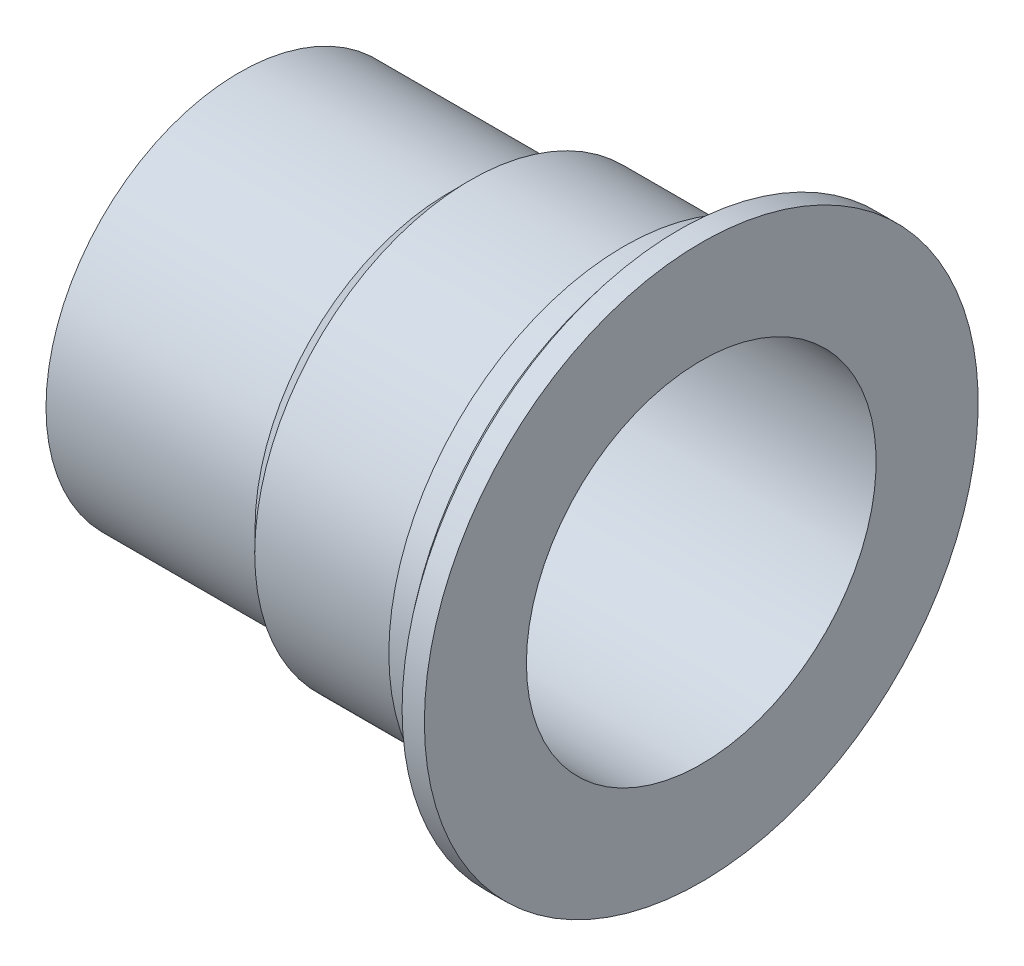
ISO-10303-21;
HEADER;
FILE_DESCRIPTION(('STEP AP214'),'2;1');
FILE_NAME('part.step','',(''),(''),'','','');
FILE_SCHEMA(('AUTOMOTIVE_DESIGN { 1 0 10303 214 1 1 1 1 }'));
ENDSEC;
DATA;
#1=APPLICATION_CONTEXT('core data for automotive mechanical design processes');
#2=APPLICATION_PROTOCOL_DEFINITION('international standard','automotive_design',2000,#1);
#3=PRODUCT_CONTEXT('',#1,'mechanical');
#4=PRODUCT('Part','Part','',(#3));
#5=PRODUCT_RELATED_PRODUCT_CATEGORY('part','',(#4));
#6=PRODUCT_DEFINITION_FORMATION('','',#4);
#7=PRODUCT_DEFINITION_CONTEXT('part definition',#1,'design');
#8=PRODUCT_DEFINITION('design','',#6,#7);
#9=PRODUCT_DEFINITION_SHAPE('','',#8);
#10=(LENGTH_UNIT() NAMED_UNIT(*) SI_UNIT(.MILLI.,.METRE.));
#11=(NAMED_UNIT(*) PLANE_ANGLE_UNIT() SI_UNIT($,.RADIAN.));
#12=(NAMED_UNIT(*) SI_UNIT($,.STERADIAN.) SOLID_ANGLE_UNIT());
#13=UNCERTAINTY_MEASURE_WITH_UNIT(LENGTH_MEASURE(1.E-05),#10,'distance_accuracy_value','');
#14=(GEOMETRIC_REPRESENTATION_CONTEXT(3) GLOBAL_UNCERTAINTY_ASSIGNED_CONTEXT((#13)) GLOBAL_UNIT_ASSIGNED_CONTEXT((#10,
#11,#12)) REPRESENTATION_CONTEXT('',''));
#15=CARTESIAN_POINT('',(0.,0.,0.));
#16=DIRECTION('',(0.,0.,1.));
#17=DIRECTION('',(1.,0.,0.));
#18=AXIS2_PLACEMENT_3D('',#15,#16,#17);
#19=CARTESIAN_POINT('',(239.842,45.71498772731,-25.62336));
#20=DIRECTION('',(-1.,0.,0.));
#21=DIRECTION('',(0.,0.,1.));
#22=AXIS2_PLACEMENT_3D('',#19,#20,#21);
#23=PLANE('',#22);
#24=CARTESIAN_POINT('',(239.842,0.,0.));
#25=DIRECTION('',(-1.,0.,0.));
#26=DIRECTION('',(0.,0.,1.));
#27=AXIS2_PLACEMENT_3D('',#24,#25,#26);
#28=CIRCLE('',#27,16.0315374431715);
#29=CARTESIAN_POINT('',(239.842,0.,16.0315374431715));
#30=VERTEX_POINT('',#29);
#31=EDGE_CURVE('E37',#30,#30,#28,.F.);
#32=ORIENTED_EDGE('',*,*,#31,.T.);
#33=EDGE_LOOP('',(#32));
#34=FACE_BOUND('',#33,.T.);
#35=CARTESIAN_POINT('',(239.842,0.,0.));
#36=DIRECTION('',(-1.,0.,0.));
#37=DIRECTION('',(0.,0.,1.));
#38=AXIS2_PLACEMENT_3D('',#35,#36,#37);
#39=CIRCLE('',#38,17.61236);
#40=CARTESIAN_POINT('',(239.842,0.,17.61236));
#41=VERTEX_POINT('',#40);
#42=EDGE_CURVE('E49',#41,#41,#39,.T.);
#43=ORIENTED_EDGE('',*,*,#42,.T.);
#44=EDGE_LOOP('',(#43));
#45=FACE_BOUND('',#44,.T.);
#46=ADVANCED_FACE('F33',(#34,#45),#23,.T.);
#47=CARTESIAN_POINT('',(278.892,0.,0.));
#48=DIRECTION('',(1.,0.,0.));
#49=DIRECTION('',(0.,0.,-1.));
#50=AXIS2_PLACEMENT_3D('',#47,#48,#49);
#51=PLANE('',#50);
#52=CARTESIAN_POINT('',(278.892,0.,0.));
#53=DIRECTION('',(-1.,0.,0.));
#54=DIRECTION('',(0.,0.,1.));
#55=AXIS2_PLACEMENT_3D('',#52,#53,#54);
#56=CIRCLE('',#55,21.42236);
#57=CARTESIAN_POINT('',(278.892,0.,21.42236));
#58=VERTEX_POINT('',#57);
#59=EDGE_CURVE('E71',#58,#58,#56,.T.);
#60=ORIENTED_EDGE('',*,*,#59,.F.);
#61=EDGE_LOOP('',(#60));
#62=FACE_BOUND('',#61,.T.);
#63=CARTESIAN_POINT('',(278.892,0.,0.));
#64=DIRECTION('',(-1.,0.,0.));
#65=DIRECTION('',(0.,0.,1.));
#66=AXIS2_PLACEMENT_3D('',#63,#64,#65);
#67=CIRCLE('',#66,23.96236);
#68=CARTESIAN_POINT('',(278.892,0.,23.96236));
#69=VERTEX_POINT('',#68);
#70=EDGE_CURVE('E68',#69,#69,#67,.T.);
#71=ORIENTED_EDGE('',*,*,#70,.T.);
#72=EDGE_LOOP('',(#71));
#73=FACE_BOUND('',#72,.T.);
#74=ADVANCED_FACE('F93',(#62,#73),#51,.F.);
#75=CARTESIAN_POINT('',(278.892,0.,0.));
#76=DIRECTION('',(1.,0.,0.));
#77=DIRECTION('',(0.,0.,-1.));
#78=AXIS2_PLACEMENT_3D('',#75,#76,#77);
#79=CONICAL_SURFACE('',#78,23.96236,0.896055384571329);
#80=CARTESIAN_POINT('',(279.908,0.,0.));
#81=DIRECTION('',(-1.,0.,0.));
#82=DIRECTION('',(0.,0.,1.));
#83=AXIS2_PLACEMENT_3D('',#80,#81,#82);
#84=CIRCLE('',#83,25.23236);
#85=CARTESIAN_POINT('',(279.908,0.,25.23236));
#86=VERTEX_POINT('',#85);
#87=EDGE_CURVE('E63',#86,#86,#84,.T.);
#88=ORIENTED_EDGE('',*,*,#87,.T.);
#89=EDGE_LOOP('',(#88));
#90=FACE_BOUND('',#89,.T.);
#91=ORIENTED_EDGE('',*,*,#70,.F.);
#92=EDGE_LOOP('',(#91));
#93=FACE_BOUND('',#92,.T.);
#94=ADVANCED_FACE('F96',(#90,#93),#79,.T.);
#95=CARTESIAN_POINT('',(0.,0.,0.));
#96=DIRECTION('',(-1.,0.,0.));
#97=DIRECTION('',(0.,0.,1.));
#98=AXIS2_PLACEMENT_3D('',#95,#96,#97);
#99=CYLINDRICAL_SURFACE('',#98,25.23236);
#100=CARTESIAN_POINT('',(281.94,0.,0.));
#101=DIRECTION('',(-1.,0.,0.));
#102=DIRECTION('',(0.,0.,1.));
#103=AXIS2_PLACEMENT_3D('',#100,#101,#102);
#104=CIRCLE('',#103,25.23236);
#105=CARTESIAN_POINT('',(281.94,0.,25.23236));
#106=VERTEX_POINT('',#105);
#107=EDGE_CURVE('E58',#106,#106,#104,.T.);
#108=ORIENTED_EDGE('',*,*,#107,.T.);
#109=EDGE_LOOP('',(#108));
#110=FACE_BOUND('',#109,.T.);
#111=ORIENTED_EDGE('',*,*,#87,.F.);
#112=EDGE_LOOP('',(#111));
#113=FACE_BOUND('',#112,.T.);
#114=ADVANCED_FACE('F101',(#110,#113),#99,.T.);
#115=CARTESIAN_POINT('',(281.94,0.,0.));
#116=DIRECTION('',(-1.,0.,0.));
#117=DIRECTION('',(0.,0.,1.));
#118=AXIS2_PLACEMENT_3D('',#115,#116,#117);
#119=PLANE('',#118);
#120=ORIENTED_EDGE('',*,*,#107,.F.);
#121=EDGE_LOOP('',(#120));
#122=FACE_BOUND('',#121,.T.);
#123=CARTESIAN_POINT('',(281.94,0.,0.));
#124=DIRECTION('',(-1.,0.,0.));
#125=DIRECTION('',(0.,0.,1.));
#126=AXIS2_PLACEMENT_3D('',#123,#124,#125);
#127=CIRCLE('',#126,15.9335460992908);
#128=CARTESIAN_POINT('',(281.94,0.,15.9335460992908));
#129=VERTEX_POINT('',#128);
#130=EDGE_CURVE('E54',#129,#129,#127,.T.);
#131=ORIENTED_EDGE('',*,*,#130,.T.);
#132=EDGE_LOOP('',(#131));
#133=FACE_BOUND('',#132,.T.);
#134=ADVANCED_FACE('F107',(#122,#133),#119,.F.);
#135=CARTESIAN_POINT('',(34.29,0.,0.));
#136=DIRECTION('',(-1.,0.,0.));
#137=DIRECTION('',(0.,0.,1.));
#138=AXIS2_PLACEMENT_3D('',#135,#136,#137);
#139=CONICAL_SURFACE('',#138,16.51,0.00232769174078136);
#140=ORIENTED_EDGE('',*,*,#130,.F.);
#141=EDGE_LOOP('',(#140));
#142=FACE_BOUND('',#141,.T.);
#143=ORIENTED_EDGE('',*,*,#31,.F.);
#144=EDGE_LOOP('',(#143));
#145=FACE_BOUND('',#144,.T.);
#146=ADVANCED_FACE('F35',(#142,#145),#139,.F.);
#147=CARTESIAN_POINT('',(0.,0.,0.));
#148=DIRECTION('',(-1.,0.,0.));
#149=DIRECTION('',(0.,0.,1.));
#150=AXIS2_PLACEMENT_3D('',#147,#148,#149);
#151=CYLINDRICAL_SURFACE('',#150,21.42236);
#152=CARTESIAN_POINT('',(274.892,0.,0.));
#153=DIRECTION('',(-1.,0.,0.));
#154=DIRECTION('',(0.,0.,1.));
#155=AXIS2_PLACEMENT_3D('',#152,#153,#154);
#156=CIRCLE('',#155,21.42236);
#157=CARTESIAN_POINT('',(274.892,0.,21.42236));
#158=VERTEX_POINT('',#157);
#159=EDGE_CURVE('E74',#158,#158,#156,.T.);
#160=ORIENTED_EDGE('',*,*,#159,.F.);
#161=EDGE_LOOP('',(#160));
#162=FACE_BOUND('',#161,.T.);
#163=ORIENTED_EDGE('',*,*,#59,.T.);
#164=EDGE_LOOP('',(#163));
#165=FACE_BOUND('',#164,.T.);
#166=ADVANCED_FACE('F84',(#162,#165),#151,.T.);
#167=CARTESIAN_POINT('',(274.892,0.,0.));
#168=DIRECTION('',(1.,0.,0.));
#169=DIRECTION('',(0.,0.,-1.));
#170=AXIS2_PLACEMENT_3D('',#167,#168,#169);
#171=PLANE('',#170);
#172=CARTESIAN_POINT('',(274.892,0.,0.));
#173=DIRECTION('',(-1.,0.,0.));
#174=DIRECTION('',(0.,0.,1.));
#175=AXIS2_PLACEMENT_3D('',#172,#173,#174);
#176=CIRCLE('',#175,19.64436);
#177=CARTESIAN_POINT('',(274.892,0.,19.64436));
#178=VERTEX_POINT('',#177);
#179=EDGE_CURVE('E46',#178,#178,#176,.T.);
#180=ORIENTED_EDGE('',*,*,#179,.F.);
#181=EDGE_LOOP('',(#180));
#182=FACE_BOUND('',#181,.T.);
#183=ORIENTED_EDGE('',*,*,#159,.T.);
#184=EDGE_LOOP('',(#183));
#185=FACE_BOUND('',#184,.T.);
#186=ADVANCED_FACE('F81',(#182,#185),#171,.F.);
#187=CARTESIAN_POINT('',(0.,0.,0.));
#188=DIRECTION('',(-1.,0.,0.));
#189=DIRECTION('',(0.,0.,1.));
#190=AXIS2_PLACEMENT_3D('',#187,#188,#189);
#191=CYLINDRICAL_SURFACE('',#190,19.64436);
#192=CARTESIAN_POINT('',(260.892,0.,0.));
#193=DIRECTION('',(-1.,0.,0.));
#194=DIRECTION('',(0.,0.,1.));
#195=AXIS2_PLACEMENT_3D('',#192,#193,#194);
#196=CIRCLE('',#195,19.64436);
#197=CARTESIAN_POINT('',(260.892,0.,19.64436));
#198=VERTEX_POINT('',#197);
#199=EDGE_CURVE('E41',#198,#198,#196,.T.);
#200=ORIENTED_EDGE('',*,*,#199,.F.);
#201=EDGE_LOOP('',(#200));
#202=FACE_BOUND('',#201,.T.);
#203=ORIENTED_EDGE('',*,*,#179,.T.);
#204=EDGE_LOOP('',(#203));
#205=FACE_BOUND('',#204,.T.);
#206=ADVANCED_FACE('F79',(#202,#205),#191,.T.);
#207=CARTESIAN_POINT('',(260.892,0.,0.));
#208=DIRECTION('',(1.,0.,0.));
#209=DIRECTION('',(0.,0.,-1.));
#210=AXIS2_PLACEMENT_3D('',#207,#208,#209);
#211=CONICAL_SURFACE('',#210,19.64436,0.79333450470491);
#212=CARTESIAN_POINT('',(258.892,0.,0.));
#213=DIRECTION('',(-1.,0.,0.));
#214=DIRECTION('',(0.,0.,1.));
#215=AXIS2_PLACEMENT_3D('',#212,#213,#214);
#216=CIRCLE('',#215,17.61236);
#217=CARTESIAN_POINT('',(258.892,0.,17.61236));
#218=VERTEX_POINT('',#217);
#219=EDGE_CURVE('E10',#218,#218,#216,.T.);
#220=ORIENTED_EDGE('',*,*,#219,.F.);
#221=EDGE_LOOP('',(#220));
#222=FACE_BOUND('',#221,.T.);
#223=ORIENTED_EDGE('',*,*,#199,.T.);
#224=EDGE_LOOP('',(#223));
#225=FACE_BOUND('',#224,.T.);
#226=ADVANCED_FACE('F114',(#222,#225),#211,.T.);
#227=CARTESIAN_POINT('',(0.,0.,0.));
#228=DIRECTION('',(-1.,0.,0.));
#229=DIRECTION('',(0.,0.,1.));
#230=AXIS2_PLACEMENT_3D('',#227,#228,#229);
#231=CYLINDRICAL_SURFACE('',#230,17.61236);
#232=ORIENTED_EDGE('',*,*,#42,.F.);
#233=EDGE_LOOP('',(#232));
#234=FACE_BOUND('',#233,.T.);
#235=ORIENTED_EDGE('',*,*,#219,.T.);
#236=EDGE_LOOP('',(#235));
#237=FACE_BOUND('',#236,.T.);
#238=ADVANCED_FACE('F118',(#234,#237),#231,.T.);
#239=CLOSED_SHELL('',(#46,#74,#94,#114,#134,#146,#166,#186,#206,#226,#238));
#240=MANIFOLD_SOLID_BREP('B2',#239);
#241=ADVANCED_BREP_SHAPE_REPRESENTATION('',(#18,#240),#14);
#242=SHAPE_DEFINITION_REPRESENTATION(#9,#241);
ENDSEC;
END-ISO-10303-21;
